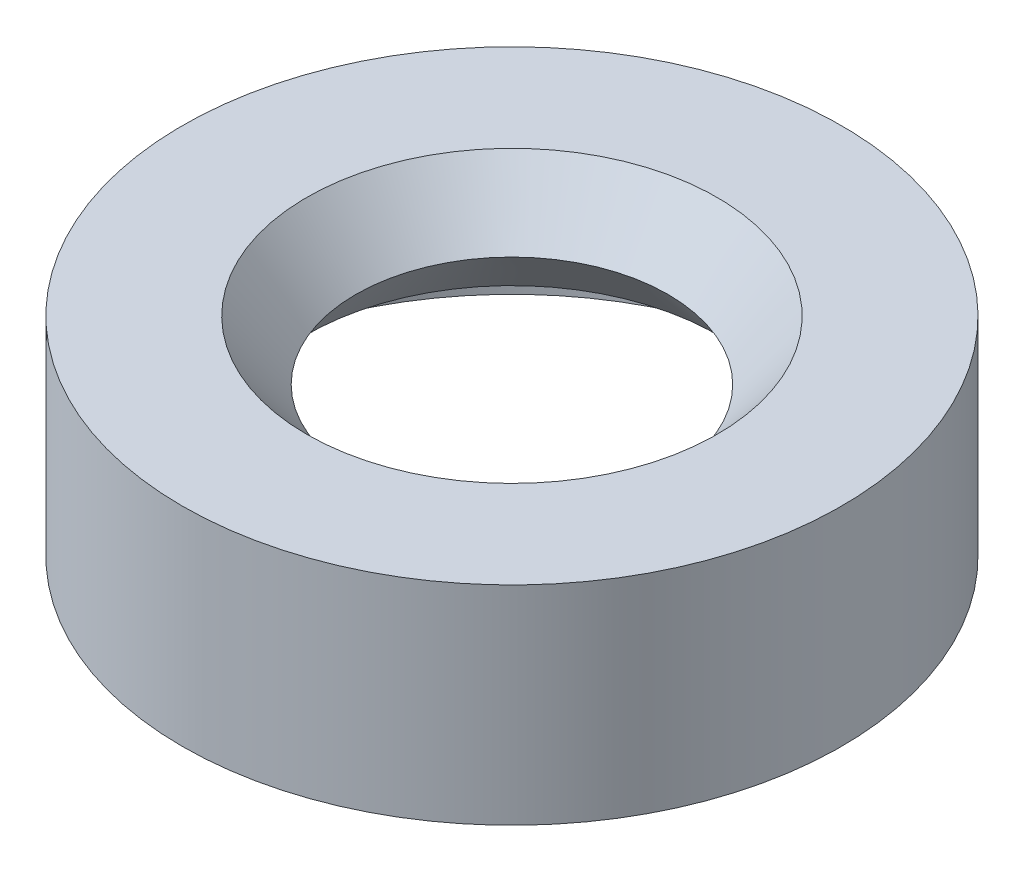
from build123d import *


with BuildPart() as part:
    # Sketch1 → Revolve-Thin2 (revolve)
    with BuildSketch(Plane.XY, mode=Mode.PRIVATE) as revolve_thin2_sk:
        Polygon((-9.5, -6), (-9.5, 0), (-5.91576731, 0), (-4.5, -1.71365372), (-5.91576731, -3.42730744), (-6.111583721, -3.265530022), (-4.829471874, -1.71365372), (-6.035392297, -0.254), (-9.246, -0.254), (-9.246, -6), align=None)
    revolve(revolve_thin2_sk.sketch.rotate(Axis((0, 8.200854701, 0), (0, -1, 0)), 270), axis=Axis((0, 8.200854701, 0), (0, -1, 0)))


solid = part.part
